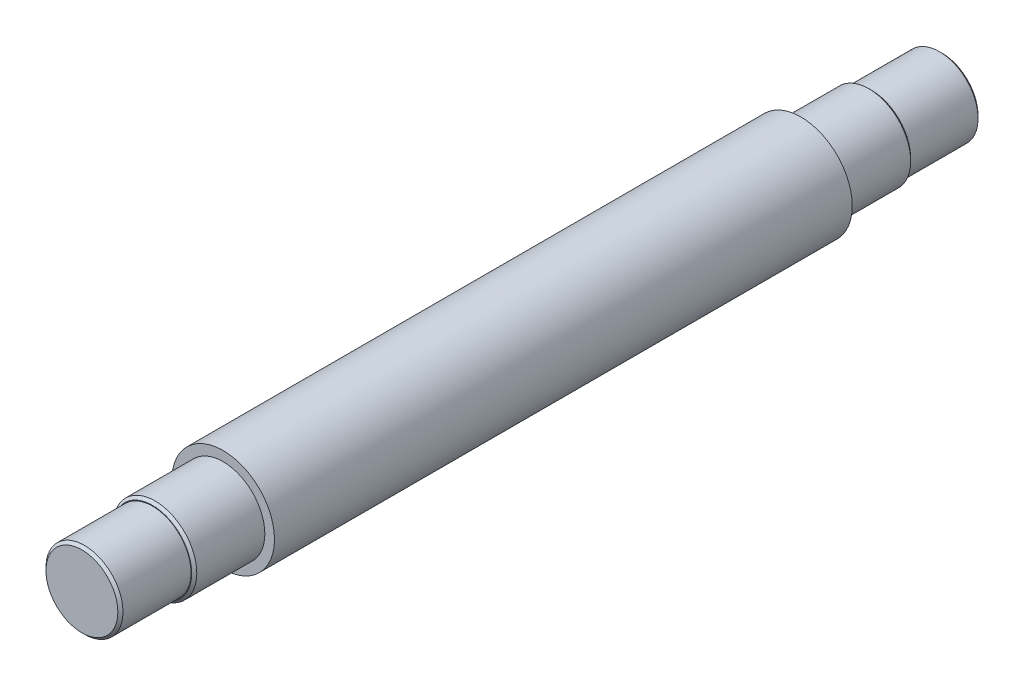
ISO-10303-21;
HEADER;
FILE_DESCRIPTION(('STEP AP214'),'2;1');
FILE_NAME('part.step','',(''),(''),'','','');
FILE_SCHEMA(('AUTOMOTIVE_DESIGN { 1 0 10303 214 1 1 1 1 }'));
ENDSEC;
DATA;
#1=APPLICATION_CONTEXT('core data for automotive mechanical design processes');
#2=APPLICATION_PROTOCOL_DEFINITION('international standard','automotive_design',2000,#1);
#3=PRODUCT_CONTEXT('',#1,'mechanical');
#4=PRODUCT('Part','Part','',(#3));
#5=PRODUCT_RELATED_PRODUCT_CATEGORY('part','',(#4));
#6=PRODUCT_DEFINITION_FORMATION('','',#4);
#7=PRODUCT_DEFINITION_CONTEXT('part definition',#1,'design');
#8=PRODUCT_DEFINITION('design','',#6,#7);
#9=PRODUCT_DEFINITION_SHAPE('','',#8);
#10=(LENGTH_UNIT() NAMED_UNIT(*) SI_UNIT(.MILLI.,.METRE.));
#11=(NAMED_UNIT(*) PLANE_ANGLE_UNIT() SI_UNIT($,.RADIAN.));
#12=(NAMED_UNIT(*) SI_UNIT($,.STERADIAN.) SOLID_ANGLE_UNIT());
#13=UNCERTAINTY_MEASURE_WITH_UNIT(LENGTH_MEASURE(1.E-05),#10,'distance_accuracy_value','');
#14=(GEOMETRIC_REPRESENTATION_CONTEXT(3) GLOBAL_UNCERTAINTY_ASSIGNED_CONTEXT((#13)) GLOBAL_UNIT_ASSIGNED_CONTEXT((#10,
#11,#12)) REPRESENTATION_CONTEXT('',''));
#15=CARTESIAN_POINT('',(0.,0.,0.));
#16=DIRECTION('',(0.,0.,1.));
#17=DIRECTION('',(1.,0.,0.));
#18=AXIS2_PLACEMENT_3D('',#15,#16,#17);
#19=CARTESIAN_POINT('',(0.,0.,450.));
#20=DIRECTION('',(0.,0.,-1.));
#21=DIRECTION('',(-1.,0.,0.));
#22=AXIS2_PLACEMENT_3D('',#19,#20,#21);
#23=CYLINDRICAL_SURFACE('',#22,40.);
#24=CARTESIAN_POINT('',(0.,0.,450.));
#25=DIRECTION('',(0.,0.,1.));
#26=DIRECTION('',(1.,0.,0.));
#27=AXIS2_PLACEMENT_3D('',#24,#25,#26);
#28=CIRCLE('',#27,40.);
#29=CARTESIAN_POINT('',(40.,0.,450.));
#30=VERTEX_POINT('',#29);
#31=EDGE_CURVE('E71',#30,#30,#28,.T.);
#32=ORIENTED_EDGE('',*,*,#31,.F.);
#33=EDGE_LOOP('',(#32));
#34=FACE_BOUND('',#33,.T.);
#35=CARTESIAN_POINT('',(0.,0.,0.));
#36=DIRECTION('',(0.,0.,1.));
#37=DIRECTION('',(1.,0.,0.));
#38=AXIS2_PLACEMENT_3D('',#35,#36,#37);
#39=CIRCLE('',#38,40.);
#40=CARTESIAN_POINT('',(40.,0.,0.));
#41=VERTEX_POINT('',#40);
#42=EDGE_CURVE('E72',#41,#41,#39,.T.);
#43=ORIENTED_EDGE('',*,*,#42,.T.);
#44=EDGE_LOOP('',(#43));
#45=FACE_BOUND('',#44,.T.);
#46=ADVANCED_FACE('F36',(#34,#45),#23,.T.);
#47=CARTESIAN_POINT('',(0.,0.,450.));
#48=DIRECTION('',(0.,0.,1.));
#49=DIRECTION('',(1.,0.,0.));
#50=AXIS2_PLACEMENT_3D('',#47,#48,#49);
#51=PLANE('',#50);
#52=CARTESIAN_POINT('',(0.,0.,450.));
#53=DIRECTION('',(0.,0.,1.));
#54=DIRECTION('',(1.,0.,0.));
#55=AXIS2_PLACEMENT_3D('',#52,#53,#54);
#56=CIRCLE('',#55,32.5);
#57=CARTESIAN_POINT('',(32.5,0.,450.));
#58=VERTEX_POINT('',#57);
#59=EDGE_CURVE('E75',#58,#58,#56,.T.);
#60=ORIENTED_EDGE('',*,*,#59,.F.);
#61=EDGE_LOOP('',(#60));
#62=FACE_BOUND('',#61,.T.);
#63=ORIENTED_EDGE('',*,*,#31,.T.);
#64=EDGE_LOOP('',(#63));
#65=FACE_BOUND('',#64,.T.);
#66=ADVANCED_FACE('F106',(#62,#65),#51,.T.);
#67=CARTESIAN_POINT('',(0.,0.,0.));
#68=DIRECTION('',(0.,0.,1.));
#69=DIRECTION('',(1.,0.,0.));
#70=AXIS2_PLACEMENT_3D('',#67,#68,#69);
#71=PLANE('',#70);
#72=CARTESIAN_POINT('',(0.,0.,0.));
#73=DIRECTION('',(0.,0.,1.));
#74=DIRECTION('',(1.,0.,0.));
#75=AXIS2_PLACEMENT_3D('',#72,#73,#74);
#76=CIRCLE('',#75,32.5);
#77=CARTESIAN_POINT('',(32.5,0.,0.));
#78=VERTEX_POINT('',#77);
#79=EDGE_CURVE('E68',#78,#78,#76,.F.);
#80=ORIENTED_EDGE('',*,*,#79,.F.);
#81=EDGE_LOOP('',(#80));
#82=FACE_BOUND('',#81,.T.);
#83=ORIENTED_EDGE('',*,*,#42,.F.);
#84=EDGE_LOOP('',(#83));
#85=FACE_BOUND('',#84,.T.);
#86=ADVANCED_FACE('F102',(#82,#85),#71,.F.);
#87=CARTESIAN_POINT('',(0.,0.,505.));
#88=DIRECTION('',(0.,0.,-1.));
#89=DIRECTION('',(-1.,0.,0.));
#90=AXIS2_PLACEMENT_3D('',#87,#88,#89);
#91=CYLINDRICAL_SURFACE('',#90,32.5);
#92=CARTESIAN_POINT('',(0.,0.,503.));
#93=DIRECTION('',(0.,0.,1.));
#94=DIRECTION('',(1.,0.,0.));
#95=AXIS2_PLACEMENT_3D('',#92,#93,#94);
#96=CIRCLE('',#95,32.5);
#97=CARTESIAN_POINT('',(32.5,0.,503.));
#98=VERTEX_POINT('',#97);
#99=EDGE_CURVE('E47',#98,#98,#96,.F.);
#100=ORIENTED_EDGE('',*,*,#99,.T.);
#101=EDGE_LOOP('',(#100));
#102=FACE_BOUND('',#101,.T.);
#103=ORIENTED_EDGE('',*,*,#59,.T.);
#104=EDGE_LOOP('',(#103));
#105=FACE_BOUND('',#104,.T.);
#106=ADVANCED_FACE('F92',(#102,#105),#91,.T.);
#107=CARTESIAN_POINT('',(0.,0.,505.));
#108=DIRECTION('',(0.,0.,1.));
#109=DIRECTION('',(1.,0.,0.));
#110=AXIS2_PLACEMENT_3D('',#107,#108,#109);
#111=PLANE('',#110);
#112=CARTESIAN_POINT('',(0.,0.,505.));
#113=DIRECTION('',(0.,0.,1.));
#114=DIRECTION('',(1.,0.,0.));
#115=AXIS2_PLACEMENT_3D('',#112,#113,#114);
#116=CIRCLE('',#115,30.5000000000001);
#117=CARTESIAN_POINT('',(30.5000000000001,0.,505.));
#118=VERTEX_POINT('',#117);
#119=EDGE_CURVE('E51',#118,#118,#116,.T.);
#120=ORIENTED_EDGE('',*,*,#119,.T.);
#121=EDGE_LOOP('',(#120));
#122=FACE_BOUND('',#121,.T.);
#123=CARTESIAN_POINT('',(0.,0.,505.));
#124=DIRECTION('',(0.,0.,1.));
#125=DIRECTION('',(1.,0.,0.));
#126=AXIS2_PLACEMENT_3D('',#123,#124,#125);
#127=CIRCLE('',#126,30.);
#128=CARTESIAN_POINT('',(30.,0.,505.));
#129=VERTEX_POINT('',#128);
#130=EDGE_CURVE('E83',#129,#129,#127,.T.);
#131=ORIENTED_EDGE('',*,*,#130,.F.);
#132=EDGE_LOOP('',(#131));
#133=FACE_BOUND('',#132,.T.);
#134=ADVANCED_FACE('F89',(#122,#133),#111,.T.);
#135=CARTESIAN_POINT('',(0.,0.,-55.));
#136=DIRECTION('',(0.,0.,1.));
#137=DIRECTION('',(1.,0.,0.));
#138=AXIS2_PLACEMENT_3D('',#135,#136,#137);
#139=CYLINDRICAL_SURFACE('',#138,32.5);
#140=CARTESIAN_POINT('',(0.,0.,-53.0000000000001));
#141=DIRECTION('',(0.,0.,-1.));
#142=DIRECTION('',(-1.,0.,0.));
#143=AXIS2_PLACEMENT_3D('',#140,#141,#142);
#144=CIRCLE('',#143,32.5);
#145=CARTESIAN_POINT('',(-32.5,0.,-53.0000000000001));
#146=VERTEX_POINT('',#145);
#147=EDGE_CURVE('E62',#146,#146,#144,.F.);
#148=ORIENTED_EDGE('',*,*,#147,.T.);
#149=EDGE_LOOP('',(#148));
#150=FACE_BOUND('',#149,.T.);
#151=ORIENTED_EDGE('',*,*,#79,.T.);
#152=EDGE_LOOP('',(#151));
#153=FACE_BOUND('',#152,.T.);
#154=ADVANCED_FACE('F91',(#150,#153),#139,.T.);
#155=CARTESIAN_POINT('',(0.,0.,-55.));
#156=DIRECTION('',(0.,0.,-1.));
#157=DIRECTION('',(-1.,0.,0.));
#158=AXIS2_PLACEMENT_3D('',#155,#156,#157);
#159=PLANE('',#158);
#160=CARTESIAN_POINT('',(0.,0.,-55.));
#161=DIRECTION('',(0.,0.,-1.));
#162=DIRECTION('',(-1.,0.,0.));
#163=AXIS2_PLACEMENT_3D('',#160,#161,#162);
#164=CIRCLE('',#163,30.5000000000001);
#165=CARTESIAN_POINT('',(-30.5000000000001,0.,-55.));
#166=VERTEX_POINT('',#165);
#167=EDGE_CURVE('E65',#166,#166,#164,.T.);
#168=ORIENTED_EDGE('',*,*,#167,.T.);
#169=EDGE_LOOP('',(#168));
#170=FACE_BOUND('',#169,.T.);
#171=CARTESIAN_POINT('',(0.,0.,-55.));
#172=DIRECTION('',(0.,0.,-1.));
#173=DIRECTION('',(-1.,0.,0.));
#174=AXIS2_PLACEMENT_3D('',#171,#172,#173);
#175=CIRCLE('',#174,30.);
#176=CARTESIAN_POINT('',(-30.,0.,-55.));
#177=VERTEX_POINT('',#176);
#178=EDGE_CURVE('E80',#177,#177,#175,.T.);
#179=ORIENTED_EDGE('',*,*,#178,.F.);
#180=EDGE_LOOP('',(#179));
#181=FACE_BOUND('',#180,.T.);
#182=ADVANCED_FACE('F99',(#170,#181),#159,.T.);
#183=CARTESIAN_POINT('',(0.,0.,-110.));
#184=DIRECTION('',(0.,0.,1.));
#185=DIRECTION('',(1.,0.,0.));
#186=AXIS2_PLACEMENT_3D('',#183,#184,#185);
#187=CYLINDRICAL_SURFACE('',#186,30.);
#188=CARTESIAN_POINT('',(0.,0.,-108.));
#189=DIRECTION('',(0.,0.,-1.));
#190=DIRECTION('',(-1.,0.,0.));
#191=AXIS2_PLACEMENT_3D('',#188,#189,#190);
#192=CIRCLE('',#191,30.);
#193=CARTESIAN_POINT('',(-30.,0.,-108.));
#194=VERTEX_POINT('',#193);
#195=EDGE_CURVE('E10',#194,#194,#192,.F.);
#196=ORIENTED_EDGE('',*,*,#195,.T.);
#197=EDGE_LOOP('',(#196));
#198=FACE_BOUND('',#197,.T.);
#199=ORIENTED_EDGE('',*,*,#178,.T.);
#200=EDGE_LOOP('',(#199));
#201=FACE_BOUND('',#200,.T.);
#202=ADVANCED_FACE('F183',(#198,#201),#187,.T.);
#203=CARTESIAN_POINT('',(0.,0.,-110.));
#204=DIRECTION('',(0.,0.,-1.));
#205=DIRECTION('',(-1.,0.,0.));
#206=AXIS2_PLACEMENT_3D('',#203,#204,#205);
#207=PLANE('',#206);
#208=CARTESIAN_POINT('',(0.,0.,-110.));
#209=DIRECTION('',(0.,0.,-1.));
#210=DIRECTION('',(-1.,0.,0.));
#211=AXIS2_PLACEMENT_3D('',#208,#209,#210);
#212=CIRCLE('',#211,28.);
#213=CARTESIAN_POINT('',(-28.,0.,-110.));
#214=VERTEX_POINT('',#213);
#215=EDGE_CURVE('E43',#214,#214,#212,.T.);
#216=ORIENTED_EDGE('',*,*,#215,.T.);
#217=EDGE_LOOP('',(#216));
#218=FACE_BOUND('',#217,.T.);
#219=ADVANCED_FACE('F172',(#218),#207,.T.);
#220=CARTESIAN_POINT('',(0.,0.,560.));
#221=DIRECTION('',(0.,0.,-1.));
#222=DIRECTION('',(-1.,0.,0.));
#223=AXIS2_PLACEMENT_3D('',#220,#221,#222);
#224=CYLINDRICAL_SURFACE('',#223,30.);
#225=CARTESIAN_POINT('',(0.,0.,558.));
#226=DIRECTION('',(0.,0.,1.));
#227=DIRECTION('',(1.,0.,0.));
#228=AXIS2_PLACEMENT_3D('',#225,#226,#227);
#229=CIRCLE('',#228,30.);
#230=CARTESIAN_POINT('',(30.,0.,558.));
#231=VERTEX_POINT('',#230);
#232=EDGE_CURVE('E56',#231,#231,#229,.F.);
#233=ORIENTED_EDGE('',*,*,#232,.T.);
#234=EDGE_LOOP('',(#233));
#235=FACE_BOUND('',#234,.T.);
#236=ORIENTED_EDGE('',*,*,#130,.T.);
#237=EDGE_LOOP('',(#236));
#238=FACE_BOUND('',#237,.T.);
#239=ADVANCED_FACE('F87',(#235,#238),#224,.T.);
#240=CARTESIAN_POINT('',(0.,0.,560.));
#241=DIRECTION('',(0.,0.,1.));
#242=DIRECTION('',(1.,0.,0.));
#243=AXIS2_PLACEMENT_3D('',#240,#241,#242);
#244=PLANE('',#243);
#245=CARTESIAN_POINT('',(0.,0.,560.));
#246=DIRECTION('',(0.,0.,1.));
#247=DIRECTION('',(1.,0.,0.));
#248=AXIS2_PLACEMENT_3D('',#245,#246,#247);
#249=CIRCLE('',#248,28.);
#250=CARTESIAN_POINT('',(28.,0.,560.));
#251=VERTEX_POINT('',#250);
#252=EDGE_CURVE('E59',#251,#251,#249,.T.);
#253=ORIENTED_EDGE('',*,*,#252,.T.);
#254=EDGE_LOOP('',(#253));
#255=FACE_BOUND('',#254,.T.);
#256=ADVANCED_FACE('F122',(#255),#244,.T.);
#257=CARTESIAN_POINT('',(0.,0.,-55.));
#258=DIRECTION('',(0.,0.,1.));
#259=DIRECTION('',(1.,0.,0.));
#260=AXIS2_PLACEMENT_3D('',#257,#258,#259);
#261=CONICAL_SURFACE('',#260,30.5000000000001,0.785398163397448);
#262=ORIENTED_EDGE('',*,*,#147,.F.);
#263=EDGE_LOOP('',(#262));
#264=FACE_BOUND('',#263,.T.);
#265=ORIENTED_EDGE('',*,*,#167,.F.);
#266=EDGE_LOOP('',(#265));
#267=FACE_BOUND('',#266,.T.);
#268=ADVANCED_FACE('F118',(#264,#267),#261,.T.);
#269=CARTESIAN_POINT('',(0.,0.,560.));
#270=DIRECTION('',(0.,0.,-1.));
#271=DIRECTION('',(-1.,0.,0.));
#272=AXIS2_PLACEMENT_3D('',#269,#270,#271);
#273=CONICAL_SURFACE('',#272,28.,0.785398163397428);
#274=ORIENTED_EDGE('',*,*,#232,.F.);
#275=EDGE_LOOP('',(#274));
#276=FACE_BOUND('',#275,.T.);
#277=ORIENTED_EDGE('',*,*,#252,.F.);
#278=EDGE_LOOP('',(#277));
#279=FACE_BOUND('',#278,.T.);
#280=ADVANCED_FACE('F121',(#276,#279),#273,.T.);
#281=CARTESIAN_POINT('',(0.,0.,505.));
#282=DIRECTION('',(0.,0.,-1.));
#283=DIRECTION('',(-1.,0.,0.));
#284=AXIS2_PLACEMENT_3D('',#281,#282,#283);
#285=CONICAL_SURFACE('',#284,30.5000000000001,0.785398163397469);
#286=ORIENTED_EDGE('',*,*,#99,.F.);
#287=EDGE_LOOP('',(#286));
#288=FACE_BOUND('',#287,.T.);
#289=ORIENTED_EDGE('',*,*,#119,.F.);
#290=EDGE_LOOP('',(#289));
#291=FACE_BOUND('',#290,.T.);
#292=ADVANCED_FACE('F125',(#288,#291),#285,.T.);
#293=CARTESIAN_POINT('',(0.,0.,-110.));
#294=DIRECTION('',(0.,0.,1.));
#295=DIRECTION('',(1.,0.,0.));
#296=AXIS2_PLACEMENT_3D('',#293,#294,#295);
#297=CONICAL_SURFACE('',#296,28.,0.785398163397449);
#298=ORIENTED_EDGE('',*,*,#195,.F.);
#299=EDGE_LOOP('',(#298));
#300=FACE_BOUND('',#299,.T.);
#301=ORIENTED_EDGE('',*,*,#215,.F.);
#302=EDGE_LOOP('',(#301));
#303=FACE_BOUND('',#302,.T.);
#304=ADVANCED_FACE('F38',(#300,#303),#297,.T.);
#305=CLOSED_SHELL('',(#46,#66,#86,#106,#134,#154,#182,#202,#219,#239,#256,#268,#280,#292,#304));
#306=MANIFOLD_SOLID_BREP('B2',#305);
#307=ADVANCED_BREP_SHAPE_REPRESENTATION('',(#18,#306),#14);
#308=SHAPE_DEFINITION_REPRESENTATION(#9,#307);
ENDSEC;
END-ISO-10303-21;
